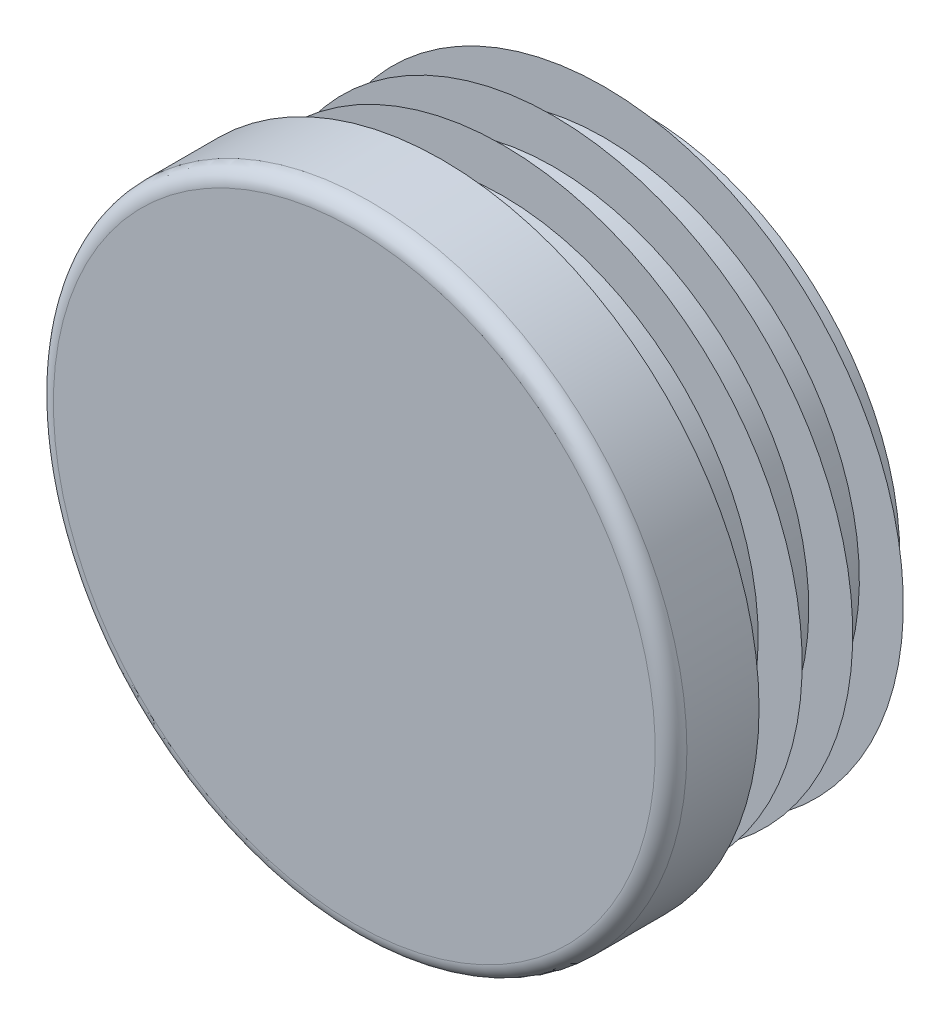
ISO-10303-21;
HEADER;
FILE_DESCRIPTION(('STEP AP214'),'2;1');
FILE_NAME('part.step','',(''),(''),'','','');
FILE_SCHEMA(('AUTOMOTIVE_DESIGN { 1 0 10303 214 1 1 1 1 }'));
ENDSEC;
DATA;
#1=APPLICATION_CONTEXT('core data for automotive mechanical design processes');
#2=APPLICATION_PROTOCOL_DEFINITION('international standard','automotive_design',2000,#1);
#3=PRODUCT_CONTEXT('',#1,'mechanical');
#4=PRODUCT('Part','Part','',(#3));
#5=PRODUCT_RELATED_PRODUCT_CATEGORY('part','',(#4));
#6=PRODUCT_DEFINITION_FORMATION('','',#4);
#7=PRODUCT_DEFINITION_CONTEXT('part definition',#1,'design');
#8=PRODUCT_DEFINITION('design','',#6,#7);
#9=PRODUCT_DEFINITION_SHAPE('','',#8);
#10=(LENGTH_UNIT() NAMED_UNIT(*) SI_UNIT(.MILLI.,.METRE.));
#11=(NAMED_UNIT(*) PLANE_ANGLE_UNIT() SI_UNIT($,.RADIAN.));
#12=(NAMED_UNIT(*) SI_UNIT($,.STERADIAN.) SOLID_ANGLE_UNIT());
#13=UNCERTAINTY_MEASURE_WITH_UNIT(LENGTH_MEASURE(1.E-05),#10,'distance_accuracy_value','');
#14=(GEOMETRIC_REPRESENTATION_CONTEXT(3) GLOBAL_UNCERTAINTY_ASSIGNED_CONTEXT((#13)) GLOBAL_UNIT_ASSIGNED_CONTEXT((#10,
#11,#12)) REPRESENTATION_CONTEXT('',''));
#15=CARTESIAN_POINT('',(0.,0.,0.));
#16=DIRECTION('',(0.,0.,1.));
#17=DIRECTION('',(1.,0.,0.));
#18=AXIS2_PLACEMENT_3D('',#15,#16,#17);
#19=CARTESIAN_POINT('',(0.,0.,5.));
#20=DIRECTION('',(0.,0.,-1.));
#21=DIRECTION('',(0.,1.,0.));
#22=AXIS2_PLACEMENT_3D('',#19,#20,#21);
#23=PLANE('',#22);
#24=CARTESIAN_POINT('',(0.,0.,5.));
#25=DIRECTION('',(0.,0.,-1.));
#26=DIRECTION('',(0.,1.,0.));
#27=AXIS2_PLACEMENT_3D('',#24,#25,#26);
#28=CIRCLE('',#27,17.1);
#29=CARTESIAN_POINT('',(0.,17.1,5.));
#30=VERTEX_POINT('',#29);
#31=EDGE_CURVE('E8',#30,#30,#28,.T.);
#32=ORIENTED_EDGE('',*,*,#31,.F.);
#33=EDGE_LOOP('',(#32));
#34=FACE_BOUND('',#33,.T.);
#35=ADVANCED_FACE('F12',(#34),#23,.F.);
#36=CARTESIAN_POINT('',(0.,0.,4.1));
#37=DIRECTION('',(0.,0.,-1.));
#38=DIRECTION('',(0.,1.,0.));
#39=AXIS2_PLACEMENT_3D('',#36,#37,#38);
#40=TOROIDAL_SURFACE('',#39,17.1,0.9);
#41=ORIENTED_EDGE('',*,*,#31,.T.);
#42=EDGE_LOOP('',(#41));
#43=FACE_BOUND('',#42,.T.);
#44=CARTESIAN_POINT('',(0.,0.,4.1));
#45=DIRECTION('',(0.,0.,-1.));
#46=DIRECTION('',(0.,1.,0.));
#47=AXIS2_PLACEMENT_3D('',#44,#45,#46);
#48=CIRCLE('',#47,18.);
#49=CARTESIAN_POINT('',(0.,18.,4.1));
#50=VERTEX_POINT('',#49);
#51=EDGE_CURVE('E18',#50,#50,#48,.T.);
#52=ORIENTED_EDGE('',*,*,#51,.F.);
#53=EDGE_LOOP('',(#52));
#54=FACE_BOUND('',#53,.T.);
#55=ADVANCED_FACE('F159',(#43,#54),#40,.T.);
#56=CARTESIAN_POINT('',(0.,0.,-11.5));
#57=DIRECTION('',(0.,0.,-1.));
#58=DIRECTION('',(0.,1.,0.));
#59=AXIS2_PLACEMENT_3D('',#56,#57,#58);
#60=CYLINDRICAL_SURFACE('',#59,18.);
#61=CARTESIAN_POINT('',(0.,0.,0.));
#62=DIRECTION('',(0.,0.,-1.));
#63=DIRECTION('',(0.,1.,0.));
#64=AXIS2_PLACEMENT_3D('',#61,#62,#63);
#65=CIRCLE('',#64,18.);
#66=CARTESIAN_POINT('',(0.,18.,0.));
#67=VERTEX_POINT('',#66);
#68=EDGE_CURVE('E22',#67,#67,#65,.T.);
#69=ORIENTED_EDGE('',*,*,#68,.F.);
#70=EDGE_LOOP('',(#69));
#71=FACE_BOUND('',#70,.T.);
#72=ORIENTED_EDGE('',*,*,#51,.T.);
#73=EDGE_LOOP('',(#72));
#74=FACE_BOUND('',#73,.T.);
#75=ADVANCED_FACE('F154',(#71,#74),#60,.T.);
#76=CARTESIAN_POINT('',(18.,0.,0.));
#77=DIRECTION('',(0.,0.,1.));
#78=DIRECTION('',(0.,-1.,0.));
#79=AXIS2_PLACEMENT_3D('',#76,#77,#78);
#80=PLANE('',#79);
#81=CARTESIAN_POINT('',(0.,0.,0.));
#82=DIRECTION('',(0.,0.,-1.));
#83=DIRECTION('',(0.,1.,0.));
#84=AXIS2_PLACEMENT_3D('',#81,#82,#83);
#85=CIRCLE('',#84,14.5);
#86=CARTESIAN_POINT('',(0.,14.5,0.));
#87=VERTEX_POINT('',#86);
#88=EDGE_CURVE('E26',#87,#87,#85,.T.);
#89=ORIENTED_EDGE('',*,*,#88,.F.);
#90=EDGE_LOOP('',(#89));
#91=FACE_BOUND('',#90,.T.);
#92=ORIENTED_EDGE('',*,*,#68,.T.);
#93=EDGE_LOOP('',(#92));
#94=FACE_BOUND('',#93,.T.);
#95=ADVANCED_FACE('F148',(#91,#94),#80,.F.);
#96=CARTESIAN_POINT('',(0.,0.,-11.5));
#97=DIRECTION('',(0.,0.,-1.));
#98=DIRECTION('',(0.,1.,0.));
#99=AXIS2_PLACEMENT_3D('',#96,#97,#98);
#100=CYLINDRICAL_SURFACE('',#99,14.5);
#101=CARTESIAN_POINT('',(0.,0.,-0.575));
#102=DIRECTION('',(0.,0.,-1.));
#103=DIRECTION('',(0.,1.,0.));
#104=AXIS2_PLACEMENT_3D('',#101,#102,#103);
#105=CIRCLE('',#104,14.5);
#106=CARTESIAN_POINT('',(0.,14.5,-0.575));
#107=VERTEX_POINT('',#106);
#108=EDGE_CURVE('E31',#107,#107,#105,.T.);
#109=ORIENTED_EDGE('',*,*,#108,.F.);
#110=EDGE_LOOP('',(#109));
#111=FACE_BOUND('',#110,.T.);
#112=ORIENTED_EDGE('',*,*,#88,.T.);
#113=EDGE_LOOP('',(#112));
#114=FACE_BOUND('',#113,.T.);
#115=ADVANCED_FACE('F142',(#111,#114),#100,.T.);
#116=CARTESIAN_POINT('',(14.5,0.,-0.575));
#117=DIRECTION('',(0.,0.,-1.));
#118=DIRECTION('',(0.,1.,0.));
#119=AXIS2_PLACEMENT_3D('',#116,#117,#118);
#120=PLANE('',#119);
#121=CARTESIAN_POINT('',(0.,0.,-0.575));
#122=DIRECTION('',(0.,0.,-1.));
#123=DIRECTION('',(0.,1.,0.));
#124=AXIS2_PLACEMENT_3D('',#121,#122,#123);
#125=CIRCLE('',#124,17.);
#126=CARTESIAN_POINT('',(0.,17.,-0.575));
#127=VERTEX_POINT('',#126);
#128=EDGE_CURVE('E34',#127,#127,#125,.T.);
#129=ORIENTED_EDGE('',*,*,#128,.F.);
#130=EDGE_LOOP('',(#129));
#131=FACE_BOUND('',#130,.T.);
#132=ORIENTED_EDGE('',*,*,#108,.T.);
#133=EDGE_LOOP('',(#132));
#134=FACE_BOUND('',#133,.T.);
#135=ADVANCED_FACE('F136',(#131,#134),#120,.F.);
#136=CARTESIAN_POINT('',(0.,0.,-0.575));
#137=DIRECTION('',(0.,0.,1.));
#138=DIRECTION('',(0.,-1.,0.));
#139=AXIS2_PLACEMENT_3D('',#136,#137,#138);
#140=CONICAL_SURFACE('',#139,17.,0.959931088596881);
#141=CARTESIAN_POINT('',(0.,0.,-2.32551884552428));
#142=DIRECTION('',(0.,0.,-1.));
#143=DIRECTION('',(0.,1.,0.));
#144=AXIS2_PLACEMENT_3D('',#141,#142,#143);
#145=CIRCLE('',#144,14.5);
#146=CARTESIAN_POINT('',(0.,14.5,-2.32551884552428));
#147=VERTEX_POINT('',#146);
#148=EDGE_CURVE('E37',#147,#147,#145,.T.);
#149=ORIENTED_EDGE('',*,*,#148,.F.);
#150=EDGE_LOOP('',(#149));
#151=FACE_BOUND('',#150,.T.);
#152=ORIENTED_EDGE('',*,*,#128,.T.);
#153=EDGE_LOOP('',(#152));
#154=FACE_BOUND('',#153,.T.);
#155=ADVANCED_FACE('F130',(#151,#154),#140,.T.);
#156=CARTESIAN_POINT('',(0.,0.,-11.5));
#157=DIRECTION('',(0.,0.,-1.));
#158=DIRECTION('',(0.,1.,0.));
#159=AXIS2_PLACEMENT_3D('',#156,#157,#158);
#160=CYLINDRICAL_SURFACE('',#159,14.5);
#161=CARTESIAN_POINT('',(0.,0.,-3.45));
#162=DIRECTION('',(0.,0.,-1.));
#163=DIRECTION('',(0.,1.,0.));
#164=AXIS2_PLACEMENT_3D('',#161,#162,#163);
#165=CIRCLE('',#164,14.5);
#166=CARTESIAN_POINT('',(0.,14.5,-3.45));
#167=VERTEX_POINT('',#166);
#168=EDGE_CURVE('E40',#167,#167,#165,.T.);
#169=ORIENTED_EDGE('',*,*,#168,.F.);
#170=EDGE_LOOP('',(#169));
#171=FACE_BOUND('',#170,.T.);
#172=ORIENTED_EDGE('',*,*,#148,.T.);
#173=EDGE_LOOP('',(#172));
#174=FACE_BOUND('',#173,.T.);
#175=ADVANCED_FACE('F124',(#171,#174),#160,.T.);
#176=CARTESIAN_POINT('',(14.5,0.,-3.45));
#177=DIRECTION('',(0.,0.,-1.));
#178=DIRECTION('',(0.,1.,0.));
#179=AXIS2_PLACEMENT_3D('',#176,#177,#178);
#180=PLANE('',#179);
#181=CARTESIAN_POINT('',(0.,0.,-3.45));
#182=DIRECTION('',(0.,0.,-1.));
#183=DIRECTION('',(0.,1.,0.));
#184=AXIS2_PLACEMENT_3D('',#181,#182,#183);
#185=CIRCLE('',#184,17.);
#186=CARTESIAN_POINT('',(0.,17.,-3.45));
#187=VERTEX_POINT('',#186);
#188=EDGE_CURVE('E43',#187,#187,#185,.T.);
#189=ORIENTED_EDGE('',*,*,#188,.F.);
#190=EDGE_LOOP('',(#189));
#191=FACE_BOUND('',#190,.T.);
#192=ORIENTED_EDGE('',*,*,#168,.T.);
#193=EDGE_LOOP('',(#192));
#194=FACE_BOUND('',#193,.T.);
#195=ADVANCED_FACE('F118',(#191,#194),#180,.F.);
#196=CARTESIAN_POINT('',(0.,0.,-3.45));
#197=DIRECTION('',(0.,0.,1.));
#198=DIRECTION('',(0.,-1.,0.));
#199=AXIS2_PLACEMENT_3D('',#196,#197,#198);
#200=CONICAL_SURFACE('',#199,17.,0.959931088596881);
#201=CARTESIAN_POINT('',(0.,0.,-5.20051884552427));
#202=DIRECTION('',(0.,0.,-1.));
#203=DIRECTION('',(0.,1.,0.));
#204=AXIS2_PLACEMENT_3D('',#201,#202,#203);
#205=CIRCLE('',#204,14.5);
#206=CARTESIAN_POINT('',(0.,14.5,-5.20051884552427));
#207=VERTEX_POINT('',#206);
#208=EDGE_CURVE('E46',#207,#207,#205,.T.);
#209=ORIENTED_EDGE('',*,*,#208,.F.);
#210=EDGE_LOOP('',(#209));
#211=FACE_BOUND('',#210,.T.);
#212=ORIENTED_EDGE('',*,*,#188,.T.);
#213=EDGE_LOOP('',(#212));
#214=FACE_BOUND('',#213,.T.);
#215=ADVANCED_FACE('F112',(#211,#214),#200,.T.);
#216=CARTESIAN_POINT('',(0.,0.,-11.5));
#217=DIRECTION('',(0.,0.,-1.));
#218=DIRECTION('',(0.,1.,0.));
#219=AXIS2_PLACEMENT_3D('',#216,#217,#218);
#220=CYLINDRICAL_SURFACE('',#219,14.5);
#221=CARTESIAN_POINT('',(0.,0.,-6.325));
#222=DIRECTION('',(0.,0.,-1.));
#223=DIRECTION('',(0.,1.,0.));
#224=AXIS2_PLACEMENT_3D('',#221,#222,#223);
#225=CIRCLE('',#224,14.5);
#226=CARTESIAN_POINT('',(0.,14.5,-6.325));
#227=VERTEX_POINT('',#226);
#228=EDGE_CURVE('E49',#227,#227,#225,.T.);
#229=ORIENTED_EDGE('',*,*,#228,.F.);
#230=EDGE_LOOP('',(#229));
#231=FACE_BOUND('',#230,.T.);
#232=ORIENTED_EDGE('',*,*,#208,.T.);
#233=EDGE_LOOP('',(#232));
#234=FACE_BOUND('',#233,.T.);
#235=ADVANCED_FACE('F106',(#231,#234),#220,.T.);
#236=CARTESIAN_POINT('',(14.5,0.,-6.325));
#237=DIRECTION('',(0.,0.,-1.));
#238=DIRECTION('',(0.,1.,0.));
#239=AXIS2_PLACEMENT_3D('',#236,#237,#238);
#240=PLANE('',#239);
#241=CARTESIAN_POINT('',(0.,0.,-6.325));
#242=DIRECTION('',(0.,0.,-1.));
#243=DIRECTION('',(0.,1.,0.));
#244=AXIS2_PLACEMENT_3D('',#241,#242,#243);
#245=CIRCLE('',#244,17.);
#246=CARTESIAN_POINT('',(0.,17.,-6.325));
#247=VERTEX_POINT('',#246);
#248=EDGE_CURVE('E52',#247,#247,#245,.T.);
#249=ORIENTED_EDGE('',*,*,#248,.F.);
#250=EDGE_LOOP('',(#249));
#251=FACE_BOUND('',#250,.T.);
#252=ORIENTED_EDGE('',*,*,#228,.T.);
#253=EDGE_LOOP('',(#252));
#254=FACE_BOUND('',#253,.T.);
#255=ADVANCED_FACE('F100',(#251,#254),#240,.F.);
#256=CARTESIAN_POINT('',(0.,0.,-6.325));
#257=DIRECTION('',(0.,0.,1.));
#258=DIRECTION('',(0.,-1.,0.));
#259=AXIS2_PLACEMENT_3D('',#256,#257,#258);
#260=CONICAL_SURFACE('',#259,17.,0.959931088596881);
#261=CARTESIAN_POINT('',(0.,0.,-8.07551884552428));
#262=DIRECTION('',(0.,0.,-1.));
#263=DIRECTION('',(0.,1.,0.));
#264=AXIS2_PLACEMENT_3D('',#261,#262,#263);
#265=CIRCLE('',#264,14.5);
#266=CARTESIAN_POINT('',(0.,14.5,-8.07551884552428));
#267=VERTEX_POINT('',#266);
#268=EDGE_CURVE('E55',#267,#267,#265,.T.);
#269=ORIENTED_EDGE('',*,*,#268,.F.);
#270=EDGE_LOOP('',(#269));
#271=FACE_BOUND('',#270,.T.);
#272=ORIENTED_EDGE('',*,*,#248,.T.);
#273=EDGE_LOOP('',(#272));
#274=FACE_BOUND('',#273,.T.);
#275=ADVANCED_FACE('F94',(#271,#274),#260,.T.);
#276=CARTESIAN_POINT('',(0.,0.,-11.5));
#277=DIRECTION('',(0.,0.,-1.));
#278=DIRECTION('',(0.,1.,0.));
#279=AXIS2_PLACEMENT_3D('',#276,#277,#278);
#280=CYLINDRICAL_SURFACE('',#279,14.5);
#281=CARTESIAN_POINT('',(0.,0.,-9.2));
#282=DIRECTION('',(0.,0.,-1.));
#283=DIRECTION('',(0.,1.,0.));
#284=AXIS2_PLACEMENT_3D('',#281,#282,#283);
#285=CIRCLE('',#284,14.5);
#286=CARTESIAN_POINT('',(0.,14.5,-9.2));
#287=VERTEX_POINT('',#286);
#288=EDGE_CURVE('E58',#287,#287,#285,.T.);
#289=ORIENTED_EDGE('',*,*,#288,.F.);
#290=EDGE_LOOP('',(#289));
#291=FACE_BOUND('',#290,.T.);
#292=ORIENTED_EDGE('',*,*,#268,.T.);
#293=EDGE_LOOP('',(#292));
#294=FACE_BOUND('',#293,.T.);
#295=ADVANCED_FACE('F88',(#291,#294),#280,.T.);
#296=CARTESIAN_POINT('',(14.5,0.,-9.2));
#297=DIRECTION('',(0.,0.,-1.));
#298=DIRECTION('',(0.,1.,0.));
#299=AXIS2_PLACEMENT_3D('',#296,#297,#298);
#300=PLANE('',#299);
#301=CARTESIAN_POINT('',(0.,0.,-9.2));
#302=DIRECTION('',(0.,0.,-1.));
#303=DIRECTION('',(0.,1.,0.));
#304=AXIS2_PLACEMENT_3D('',#301,#302,#303);
#305=CIRCLE('',#304,17.);
#306=CARTESIAN_POINT('',(0.,17.,-9.2));
#307=VERTEX_POINT('',#306);
#308=EDGE_CURVE('E61',#307,#307,#305,.T.);
#309=ORIENTED_EDGE('',*,*,#308,.F.);
#310=EDGE_LOOP('',(#309));
#311=FACE_BOUND('',#310,.T.);
#312=ORIENTED_EDGE('',*,*,#288,.T.);
#313=EDGE_LOOP('',(#312));
#314=FACE_BOUND('',#313,.T.);
#315=ADVANCED_FACE('F82',(#311,#314),#300,.F.);
#316=CARTESIAN_POINT('',(0.,0.,-9.2));
#317=DIRECTION('',(0.,0.,1.));
#318=DIRECTION('',(0.,-1.,0.));
#319=AXIS2_PLACEMENT_3D('',#316,#317,#318);
#320=CONICAL_SURFACE('',#319,17.,0.959931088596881);
#321=CARTESIAN_POINT('',(0.,0.,-10.9505188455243));
#322=DIRECTION('',(0.,0.,-1.));
#323=DIRECTION('',(0.,1.,0.));
#324=AXIS2_PLACEMENT_3D('',#321,#322,#323);
#325=CIRCLE('',#324,14.5);
#326=CARTESIAN_POINT('',(0.,14.5,-10.9505188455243));
#327=VERTEX_POINT('',#326);
#328=EDGE_CURVE('E64',#327,#327,#325,.T.);
#329=ORIENTED_EDGE('',*,*,#328,.F.);
#330=EDGE_LOOP('',(#329));
#331=FACE_BOUND('',#330,.T.);
#332=ORIENTED_EDGE('',*,*,#308,.T.);
#333=EDGE_LOOP('',(#332));
#334=FACE_BOUND('',#333,.T.);
#335=ADVANCED_FACE('F76',(#331,#334),#320,.T.);
#336=CARTESIAN_POINT('',(0.,0.,-11.5));
#337=DIRECTION('',(0.,0.,-1.));
#338=DIRECTION('',(0.,1.,0.));
#339=AXIS2_PLACEMENT_3D('',#336,#337,#338);
#340=CYLINDRICAL_SURFACE('',#339,14.5);
#341=CARTESIAN_POINT('',(0.,0.,-11.5));
#342=DIRECTION('',(0.,0.,-1.));
#343=DIRECTION('',(0.,1.,0.));
#344=AXIS2_PLACEMENT_3D('',#341,#342,#343);
#345=CIRCLE('',#344,14.5);
#346=CARTESIAN_POINT('',(0.,14.5,-11.5));
#347=VERTEX_POINT('',#346);
#348=EDGE_CURVE('E67',#347,#347,#345,.T.);
#349=ORIENTED_EDGE('',*,*,#348,.F.);
#350=EDGE_LOOP('',(#349));
#351=FACE_BOUND('',#350,.T.);
#352=ORIENTED_EDGE('',*,*,#328,.T.);
#353=EDGE_LOOP('',(#352));
#354=FACE_BOUND('',#353,.T.);
#355=ADVANCED_FACE('F73',(#351,#354),#340,.T.);
#356=CARTESIAN_POINT('',(14.5,0.,-11.5));
#357=DIRECTION('',(0.,0.,1.));
#358=DIRECTION('',(0.,-1.,0.));
#359=AXIS2_PLACEMENT_3D('',#356,#357,#358);
#360=PLANE('',#359);
#361=ORIENTED_EDGE('',*,*,#348,.T.);
#362=EDGE_LOOP('',(#361));
#363=FACE_BOUND('',#362,.T.);
#364=ADVANCED_FACE('F71',(#363),#360,.F.);
#365=CLOSED_SHELL('',(#35,#55,#75,#95,#115,#135,#155,#175,#195,#215,#235,#255,#275,#295,#315,
#335,#355,#364));
#366=MANIFOLD_SOLID_BREP('B1',#365);
#367=ADVANCED_BREP_SHAPE_REPRESENTATION('',(#18,#366),#14);
#368=SHAPE_DEFINITION_REPRESENTATION(#9,#367);
ENDSEC;
END-ISO-10303-21;
